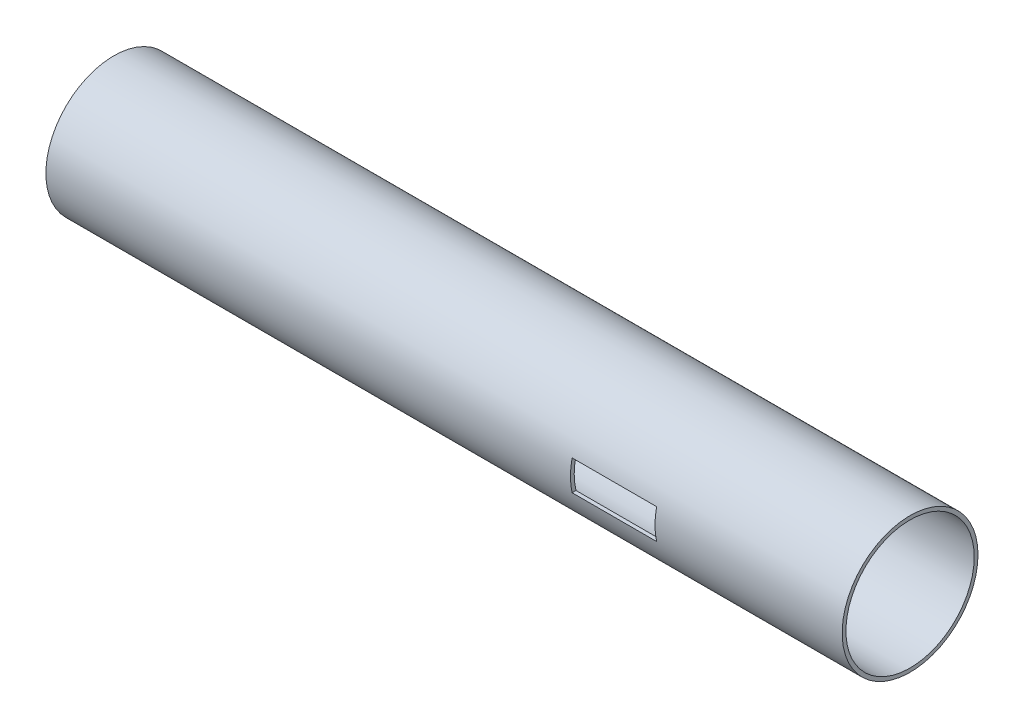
from build123d import *

# Parameters (mm, degrees)
SKETCH1_R          = 28.575
SKETCH1_R_2        = 26.9875
EXTRUDE1_DEPTH     = 334.9625
SKETCH2_W          = 35.56
SKETCH2_H          = 12.7
CUT_EXTRUDE1_DEPTH = 338.391371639


with BuildPart() as part:
    # Sketch1 → Extrude1 (new body)
    with BuildSketch(Plane(origin=(0, 0, 0), x_dir=(0, 0, -1), z_dir=(1, 0, 0))):
        Circle(SKETCH1_R)
        Circle(SKETCH1_R_2, mode=Mode.SUBTRACT)
    extrude(amount=EXTRUDE1_DEPTH)

    # Sketch2 → Cut-Extrude1 (cut, through all)
    with BuildSketch(Plane.XY):
        with Locations((238.4425, 0)):
            Rectangle(SKETCH2_W, SKETCH2_H)
    extrude(amount=CUT_EXTRUDE1_DEPTH, mode=Mode.SUBTRACT)


solid = part.part
